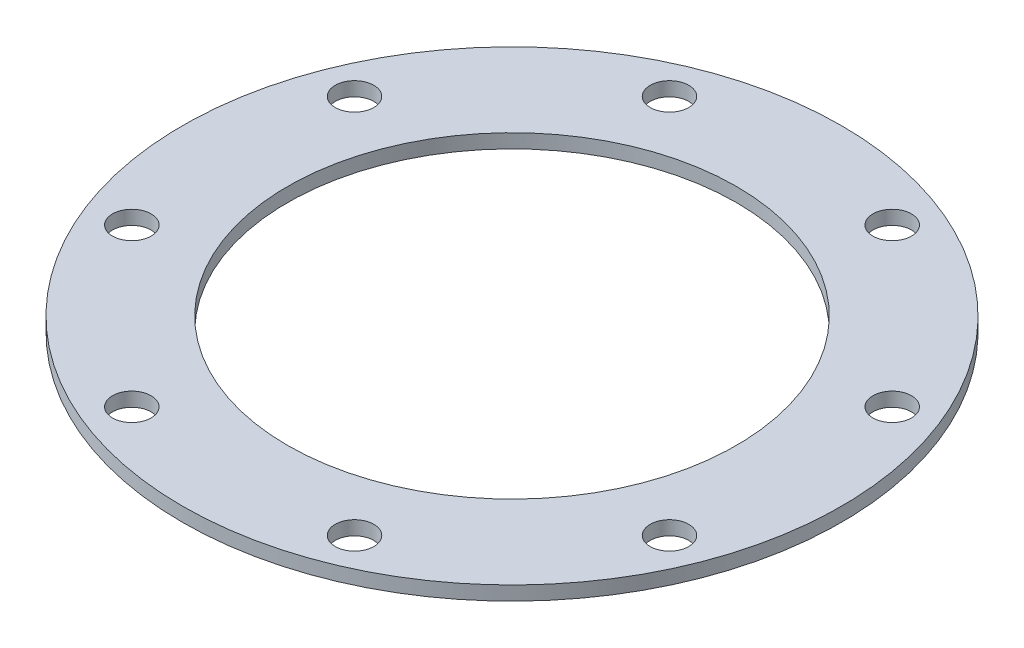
from build123d import *

# Parameters (mm, degrees)
SKETCH1_R         = 149.225
SKETCH1_R_2       = 101.6
EXTRUDE1_DEPTH    = 6.35
SKETCH2_R         = 8.73125
EXTRUDE2_DEPTH    = 212.131531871
CIRPATTERN1_COUNT = 8


with BuildPart() as part:
    # Sketch1 → Extrude1 (new body)
    with BuildSketch(Plane(origin=(0, 0, 0), x_dir=(1, 0, 0), z_dir=(0, 1, 0))):
        with Locations(Location((0, 0, 0), (0, 0, 270))):
            Circle(SKETCH1_R)
        with Locations(Location((0, 0, 0), (0, 0, 270))):
            Circle(SKETCH1_R_2, mode=Mode.SUBTRACT)
    extrude(amount=EXTRUDE1_DEPTH)

    # Sketch2 → Extrude2 (cut, through all)
    with BuildSketch(Plane(origin=(0, 6.35, 0), x_dir=(1, 0, 0), z_dir=(0, 1, 0))):
        with Locations(Location((50.423325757, 121.732676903, 0), (0, 0, 270))):
            Circle(SKETCH2_R)
    extrude2 = extrude(amount=-EXTRUDE2_DEPTH, mode=Mode.SUBTRACT)

    # CirPattern1: Extrude2 ×8 about axis
    cirpattern1_axis = Axis((0, 0, 0), (0, 1, 0))
    for i in range(1, CIRPATTERN1_COUNT):
        add(extrude2.rotate(cirpattern1_axis, i * 360 / CIRPATTERN1_COUNT), mode=Mode.SUBTRACT)


solid = part.part
